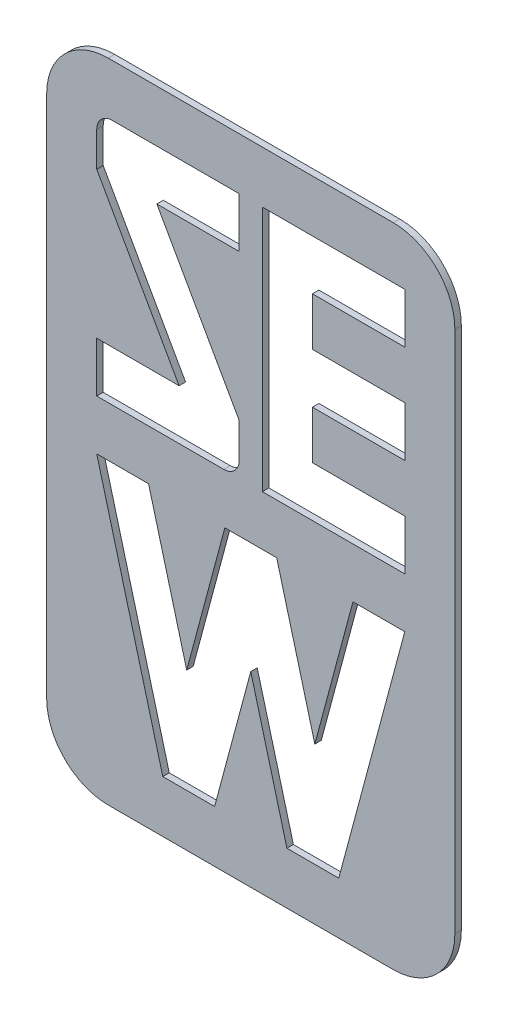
ISO-10303-21;
HEADER;
FILE_DESCRIPTION(('STEP AP214'),'2;1');
FILE_NAME('part.step','',(''),(''),'','','');
FILE_SCHEMA(('AUTOMOTIVE_DESIGN { 1 0 10303 214 1 1 1 1 }'));
ENDSEC;
DATA;
#1=APPLICATION_CONTEXT('core data for automotive mechanical design processes');
#2=APPLICATION_PROTOCOL_DEFINITION('international standard','automotive_design',2000,#1);
#3=PRODUCT_CONTEXT('',#1,'mechanical');
#4=PRODUCT('Part','Part','',(#3));
#5=PRODUCT_RELATED_PRODUCT_CATEGORY('part','',(#4));
#6=PRODUCT_DEFINITION_FORMATION('','',#4);
#7=PRODUCT_DEFINITION_CONTEXT('part definition',#1,'design');
#8=PRODUCT_DEFINITION('design','',#6,#7);
#9=PRODUCT_DEFINITION_SHAPE('','',#8);
#10=(LENGTH_UNIT() NAMED_UNIT(*) SI_UNIT(.MILLI.,.METRE.));
#11=(NAMED_UNIT(*) PLANE_ANGLE_UNIT() SI_UNIT($,.RADIAN.));
#12=(NAMED_UNIT(*) SI_UNIT($,.STERADIAN.) SOLID_ANGLE_UNIT());
#13=UNCERTAINTY_MEASURE_WITH_UNIT(LENGTH_MEASURE(1.E-05),#10,'distance_accuracy_value','');
#14=(GEOMETRIC_REPRESENTATION_CONTEXT(3) GLOBAL_UNCERTAINTY_ASSIGNED_CONTEXT((#13)) GLOBAL_UNIT_ASSIGNED_CONTEXT((#10,
#11,#12)) REPRESENTATION_CONTEXT('',''));
#15=CARTESIAN_POINT('',(0.,0.,0.));
#16=DIRECTION('',(0.,0.,1.));
#17=DIRECTION('',(1.,0.,0.));
#18=AXIS2_PLACEMENT_3D('',#15,#16,#17);
#19=CARTESIAN_POINT('',(413.81,82.63,155.5));
#20=DIRECTION('',(0.965925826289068,-0.258819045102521,0.));
#21=DIRECTION('',(0.258819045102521,0.965925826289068,0.));
#22=AXIS2_PLACEMENT_3D('',#19,#20,#21);
#23=PLANE('',#22);
#24=DIRECTION('',(0.,0.,1.));
#25=VECTOR('',#24,1.);
#26=CARTESIAN_POINT('',(413.81,82.63,155.5));
#27=LINE('',#26,#25);
#28=CARTESIAN_POINT('',(413.81,82.63,156.5));
#29=VERTEX_POINT('',#28);
#30=CARTESIAN_POINT('',(413.81,82.63,155.5));
#31=VERTEX_POINT('',#30);
#32=EDGE_CURVE('E246',#29,#31,#27,.F.);
#33=ORIENTED_EDGE('',*,*,#32,.T.);
#34=DIRECTION('',(-0.258819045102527,-0.965925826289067,0.));
#35=VECTOR('',#34,1.);
#36=CARTESIAN_POINT('',(413.81,82.63,155.5));
#37=LINE('',#36,#35);
#38=CARTESIAN_POINT('',(403.601135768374,44.53,155.5));
#39=VERTEX_POINT('',#38);
#40=EDGE_CURVE('E240',#31,#39,#37,.T.);
#41=ORIENTED_EDGE('',*,*,#40,.T.);
#42=DIRECTION('',(0.,0.,-1.));
#43=VECTOR('',#42,1.);
#44=CARTESIAN_POINT('',(403.601135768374,44.53,155.5));
#45=LINE('',#44,#43);
#46=CARTESIAN_POINT('',(403.601135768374,44.53,156.5));
#47=VERTEX_POINT('',#46);
#48=EDGE_CURVE('E616',#39,#47,#45,.F.);
#49=ORIENTED_EDGE('',*,*,#48,.T.);
#50=DIRECTION('',(-0.258819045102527,-0.965925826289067,0.));
#51=VECTOR('',#50,1.);
#52=CARTESIAN_POINT('',(413.81,82.63,156.5));
#53=LINE('',#52,#51);
#54=EDGE_CURVE('E352',#29,#47,#53,.T.);
#55=ORIENTED_EDGE('',*,*,#54,.F.);
#56=EDGE_LOOP('',(#33,#41,#49,#55));
#57=FACE_BOUND('',#56,.T.);
#58=ADVANCED_FACE('F16',(#57),#23,.F.);
#59=CARTESIAN_POINT('',(403.601135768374,44.53,155.5));
#60=DIRECTION('',(0.,-1.,0.));
#61=DIRECTION('',(0.,0.,-1.));
#62=AXIS2_PLACEMENT_3D('',#59,#60,#61);
#63=PLANE('',#62);
#64=ORIENTED_EDGE('',*,*,#48,.F.);
#65=DIRECTION('',(1.,0.,0.));
#66=VECTOR('',#65,1.);
#67=CARTESIAN_POINT('',(390.,44.53,155.5));
#68=LINE('',#67,#66);
#69=CARTESIAN_POINT('',(395.588098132,44.53,155.5));
#70=VERTEX_POINT('',#69);
#71=EDGE_CURVE('E237',#39,#70,#68,.F.);
#72=ORIENTED_EDGE('',*,*,#71,.T.);
#73=DIRECTION('',(0.,0.,1.));
#74=VECTOR('',#73,1.);
#75=CARTESIAN_POINT('',(395.588098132,44.53,155.5));
#76=LINE('',#75,#74);
#77=CARTESIAN_POINT('',(395.588098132,44.53,156.5));
#78=VERTEX_POINT('',#77);
#79=EDGE_CURVE('E613',#70,#78,#76,.T.);
#80=ORIENTED_EDGE('',*,*,#79,.T.);
#81=DIRECTION('',(1.,0.,0.));
#82=VECTOR('',#81,1.);
#83=CARTESIAN_POINT('',(390.,44.53,156.5));
#84=LINE('',#83,#82);
#85=EDGE_CURVE('E349',#47,#78,#84,.F.);
#86=ORIENTED_EDGE('',*,*,#85,.F.);
#87=EDGE_LOOP('',(#64,#72,#80,#86));
#88=FACE_BOUND('',#87,.T.);
#89=ADVANCED_FACE('F628',(#88),#63,.F.);
#90=CARTESIAN_POINT('',(395.588098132,44.53,155.5));
#91=DIRECTION('',(-0.965925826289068,-0.258819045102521,0.));
#92=DIRECTION('',(0.258819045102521,-0.965925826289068,0.));
#93=AXIS2_PLACEMENT_3D('',#90,#91,#92);
#94=PLANE('',#93);
#95=ORIENTED_EDGE('',*,*,#79,.F.);
#96=DIRECTION('',(-0.258819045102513,0.96592582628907,0.));
#97=VECTOR('',#96,1.);
#98=CARTESIAN_POINT('',(395.588098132,44.53,155.5));
#99=LINE('',#98,#97);
#100=CARTESIAN_POINT('',(390.,65.3850661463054,155.5));
#101=VERTEX_POINT('',#100);
#102=EDGE_CURVE('E234',#70,#101,#99,.T.);
#103=ORIENTED_EDGE('',*,*,#102,.T.);
#104=DIRECTION('',(0.,0.,1.));
#105=VECTOR('',#104,1.);
#106=CARTESIAN_POINT('',(390.,65.3850661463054,155.5));
#107=LINE('',#106,#105);
#108=CARTESIAN_POINT('',(390.,65.3850661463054,156.5));
#109=VERTEX_POINT('',#108);
#110=EDGE_CURVE('E610',#101,#109,#107,.T.);
#111=ORIENTED_EDGE('',*,*,#110,.T.);
#112=DIRECTION('',(-0.258819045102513,0.96592582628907,0.));
#113=VECTOR('',#112,1.);
#114=CARTESIAN_POINT('',(395.588098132,44.53,156.5));
#115=LINE('',#114,#113);
#116=EDGE_CURVE('E346',#78,#109,#115,.T.);
#117=ORIENTED_EDGE('',*,*,#116,.F.);
#118=EDGE_LOOP('',(#95,#103,#111,#117));
#119=FACE_BOUND('',#118,.T.);
#120=ADVANCED_FACE('F883',(#119),#94,.F.);
#121=CARTESIAN_POINT('',(390.,65.3850661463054,155.5));
#122=DIRECTION('',(0.965925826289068,-0.258819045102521,0.));
#123=DIRECTION('',(0.258819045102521,0.965925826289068,0.));
#124=AXIS2_PLACEMENT_3D('',#121,#122,#123);
#125=PLANE('',#124);
#126=ORIENTED_EDGE('',*,*,#110,.F.);
#127=DIRECTION('',(-0.258819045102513,-0.96592582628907,0.));
#128=VECTOR('',#127,1.);
#129=CARTESIAN_POINT('',(390.,65.3850661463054,155.5));
#130=LINE('',#129,#128);
#131=CARTESIAN_POINT('',(384.411901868,44.53,155.5));
#132=VERTEX_POINT('',#131);
#133=EDGE_CURVE('E231',#101,#132,#130,.T.);
#134=ORIENTED_EDGE('',*,*,#133,.T.);
#135=DIRECTION('',(0.,0.,-1.));
#136=VECTOR('',#135,1.);
#137=CARTESIAN_POINT('',(384.411901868,44.53,155.5));
#138=LINE('',#137,#136);
#139=CARTESIAN_POINT('',(384.411901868,44.53,156.5));
#140=VERTEX_POINT('',#139);
#141=EDGE_CURVE('E607',#132,#140,#138,.F.);
#142=ORIENTED_EDGE('',*,*,#141,.T.);
#143=DIRECTION('',(-0.258819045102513,-0.96592582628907,0.));
#144=VECTOR('',#143,1.);
#145=CARTESIAN_POINT('',(390.,65.3850661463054,156.5));
#146=LINE('',#145,#144);
#147=EDGE_CURVE('E343',#109,#140,#146,.T.);
#148=ORIENTED_EDGE('',*,*,#147,.F.);
#149=EDGE_LOOP('',(#126,#134,#142,#148));
#150=FACE_BOUND('',#149,.T.);
#151=ADVANCED_FACE('F880',(#150),#125,.F.);
#152=CARTESIAN_POINT('',(384.411901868,44.53,155.5));
#153=DIRECTION('',(0.,-1.,0.));
#154=DIRECTION('',(0.,0.,-1.));
#155=AXIS2_PLACEMENT_3D('',#152,#153,#154);
#156=PLANE('',#155);
#157=ORIENTED_EDGE('',*,*,#141,.F.);
#158=DIRECTION('',(1.,0.,0.));
#159=VECTOR('',#158,1.);
#160=CARTESIAN_POINT('',(390.,44.53,155.5));
#161=LINE('',#160,#159);
#162=CARTESIAN_POINT('',(376.398864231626,44.53,155.5));
#163=VERTEX_POINT('',#162);
#164=EDGE_CURVE('E228',#132,#163,#161,.F.);
#165=ORIENTED_EDGE('',*,*,#164,.T.);
#166=DIRECTION('',(0.,0.,1.));
#167=VECTOR('',#166,1.);
#168=CARTESIAN_POINT('',(376.398864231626,44.53,155.5));
#169=LINE('',#168,#167);
#170=CARTESIAN_POINT('',(376.398864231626,44.53,156.5));
#171=VERTEX_POINT('',#170);
#172=EDGE_CURVE('E604',#163,#171,#169,.T.);
#173=ORIENTED_EDGE('',*,*,#172,.T.);
#174=DIRECTION('',(1.,0.,0.));
#175=VECTOR('',#174,1.);
#176=CARTESIAN_POINT('',(390.,44.53,156.5));
#177=LINE('',#176,#175);
#178=EDGE_CURVE('E340',#140,#171,#177,.F.);
#179=ORIENTED_EDGE('',*,*,#178,.F.);
#180=EDGE_LOOP('',(#157,#165,#173,#179));
#181=FACE_BOUND('',#180,.T.);
#182=ADVANCED_FACE('F876',(#181),#156,.F.);
#183=CARTESIAN_POINT('',(376.398864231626,44.53,155.5));
#184=DIRECTION('',(-0.965925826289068,-0.258819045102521,0.));
#185=DIRECTION('',(0.258819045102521,-0.965925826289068,0.));
#186=AXIS2_PLACEMENT_3D('',#183,#184,#185);
#187=PLANE('',#186);
#188=ORIENTED_EDGE('',*,*,#172,.F.);
#189=DIRECTION('',(-0.258819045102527,0.965925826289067,0.));
#190=VECTOR('',#189,1.);
#191=CARTESIAN_POINT('',(376.398864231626,44.53,155.5));
#192=LINE('',#191,#190);
#193=CARTESIAN_POINT('',(366.19,82.63,155.5));
#194=VERTEX_POINT('',#193);
#195=EDGE_CURVE('E225',#163,#194,#192,.T.);
#196=ORIENTED_EDGE('',*,*,#195,.T.);
#197=DIRECTION('',(0.,0.,1.));
#198=VECTOR('',#197,1.);
#199=CARTESIAN_POINT('',(366.19,82.63,155.5));
#200=LINE('',#199,#198);
#201=CARTESIAN_POINT('',(366.19,82.63,156.5));
#202=VERTEX_POINT('',#201);
#203=EDGE_CURVE('E601',#194,#202,#200,.T.);
#204=ORIENTED_EDGE('',*,*,#203,.T.);
#205=DIRECTION('',(-0.258819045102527,0.965925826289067,0.));
#206=VECTOR('',#205,1.);
#207=CARTESIAN_POINT('',(376.398864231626,44.53,156.5));
#208=LINE('',#207,#206);
#209=EDGE_CURVE('E337',#171,#202,#208,.T.);
#210=ORIENTED_EDGE('',*,*,#209,.F.);
#211=EDGE_LOOP('',(#188,#196,#204,#210));
#212=FACE_BOUND('',#211,.T.);
#213=ADVANCED_FACE('F872',(#212),#187,.F.);
#214=CARTESIAN_POINT('',(366.19,82.63,155.5));
#215=DIRECTION('',(0.,1.,0.));
#216=DIRECTION('',(0.,0.,1.));
#217=AXIS2_PLACEMENT_3D('',#214,#215,#216);
#218=PLANE('',#217);
#219=ORIENTED_EDGE('',*,*,#203,.F.);
#220=DIRECTION('',(1.,0.,0.));
#221=VECTOR('',#220,1.);
#222=CARTESIAN_POINT('',(390.,82.63,155.5));
#223=LINE('',#222,#221);
#224=CARTESIAN_POINT('',(374.203037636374,82.63,155.5));
#225=VERTEX_POINT('',#224);
#226=EDGE_CURVE('E222',#194,#225,#223,.T.);
#227=ORIENTED_EDGE('',*,*,#226,.T.);
#228=DIRECTION('',(0.,0.,1.));
#229=VECTOR('',#228,1.);
#230=CARTESIAN_POINT('',(374.203037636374,82.63,155.5));
#231=LINE('',#230,#229);
#232=CARTESIAN_POINT('',(374.203037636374,82.63,156.5));
#233=VERTEX_POINT('',#232);
#234=EDGE_CURVE('E598',#225,#233,#231,.T.);
#235=ORIENTED_EDGE('',*,*,#234,.T.);
#236=DIRECTION('',(1.,0.,0.));
#237=VECTOR('',#236,1.);
#238=CARTESIAN_POINT('',(390.,82.63,156.5));
#239=LINE('',#238,#237);
#240=EDGE_CURVE('E334',#202,#233,#239,.T.);
#241=ORIENTED_EDGE('',*,*,#240,.F.);
#242=EDGE_LOOP('',(#219,#227,#235,#241));
#243=FACE_BOUND('',#242,.T.);
#244=ADVANCED_FACE('F868',(#243),#218,.F.);
#245=CARTESIAN_POINT('',(374.203037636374,82.63,155.5));
#246=DIRECTION('',(0.965925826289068,0.258819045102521,0.));
#247=DIRECTION('',(-0.258819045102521,0.965925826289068,0.));
#248=AXIS2_PLACEMENT_3D('',#245,#246,#247);
#249=PLANE('',#248);
#250=ORIENTED_EDGE('',*,*,#234,.F.);
#251=DIRECTION('',(0.2588190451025,-0.965925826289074,0.));
#252=VECTOR('',#251,1.);
#253=CARTESIAN_POINT('',(374.203037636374,82.63,155.5));
#254=LINE('',#253,#252);
#255=CARTESIAN_POINT('',(380.098259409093,60.6287328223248,155.5));
#256=VERTEX_POINT('',#255);
#257=EDGE_CURVE('E219',#225,#256,#254,.T.);
#258=ORIENTED_EDGE('',*,*,#257,.T.);
#259=DIRECTION('',(0.,0.,1.));
#260=VECTOR('',#259,1.);
#261=CARTESIAN_POINT('',(380.098259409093,60.6287328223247,155.5));
#262=LINE('',#261,#260);
#263=CARTESIAN_POINT('',(380.098259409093,60.6287328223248,156.5));
#264=VERTEX_POINT('',#263);
#265=EDGE_CURVE('E595',#256,#264,#262,.T.);
#266=ORIENTED_EDGE('',*,*,#265,.T.);
#267=DIRECTION('',(0.2588190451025,-0.965925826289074,0.));
#268=VECTOR('',#267,1.);
#269=CARTESIAN_POINT('',(374.203037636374,82.63,156.5));
#270=LINE('',#269,#268);
#271=EDGE_CURVE('E331',#233,#264,#270,.T.);
#272=ORIENTED_EDGE('',*,*,#271,.F.);
#273=EDGE_LOOP('',(#250,#258,#266,#272));
#274=FACE_BOUND('',#273,.T.);
#275=ADVANCED_FACE('F864',(#274),#249,.F.);
#276=CARTESIAN_POINT('',(380.098259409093,60.6287328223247,155.5));
#277=DIRECTION('',(-0.965925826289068,0.258819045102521,0.));
#278=DIRECTION('',(-0.258819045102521,-0.965925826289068,0.));
#279=AXIS2_PLACEMENT_3D('',#276,#277,#278);
#280=PLANE('',#279);
#281=ORIENTED_EDGE('',*,*,#265,.F.);
#282=DIRECTION('',(0.258819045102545,0.965925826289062,0.));
#283=VECTOR('',#282,1.);
#284=CARTESIAN_POINT('',(380.098259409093,60.6287328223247,155.5));
#285=LINE('',#284,#283);
#286=CARTESIAN_POINT('',(385.993481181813,82.6300000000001,155.5));
#287=VERTEX_POINT('',#286);
#288=EDGE_CURVE('E216',#256,#287,#285,.T.);
#289=ORIENTED_EDGE('',*,*,#288,.T.);
#290=DIRECTION('',(0.,0.,1.));
#291=VECTOR('',#290,1.);
#292=CARTESIAN_POINT('',(385.993481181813,82.63,155.5));
#293=LINE('',#292,#291);
#294=CARTESIAN_POINT('',(385.993481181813,82.6300000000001,156.5));
#295=VERTEX_POINT('',#294);
#296=EDGE_CURVE('E448',#287,#295,#293,.T.);
#297=ORIENTED_EDGE('',*,*,#296,.T.);
#298=DIRECTION('',(0.258819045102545,0.965925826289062,0.));
#299=VECTOR('',#298,1.);
#300=CARTESIAN_POINT('',(380.098259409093,60.6287328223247,156.5));
#301=LINE('',#300,#299);
#302=EDGE_CURVE('E328',#264,#295,#301,.T.);
#303=ORIENTED_EDGE('',*,*,#302,.F.);
#304=EDGE_LOOP('',(#281,#289,#297,#303));
#305=FACE_BOUND('',#304,.T.);
#306=ADVANCED_FACE('F860',(#305),#280,.F.);
#307=CARTESIAN_POINT('',(385.993481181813,82.63,155.5));
#308=DIRECTION('',(0.,1.,0.));
#309=DIRECTION('',(0.,0.,1.));
#310=AXIS2_PLACEMENT_3D('',#307,#308,#309);
#311=PLANE('',#310);
#312=ORIENTED_EDGE('',*,*,#296,.F.);
#313=DIRECTION('',(1.,0.,0.));
#314=VECTOR('',#313,1.);
#315=CARTESIAN_POINT('',(390.,82.63,155.5));
#316=LINE('',#315,#314);
#317=CARTESIAN_POINT('',(394.006518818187,82.63,155.5));
#318=VERTEX_POINT('',#317);
#319=EDGE_CURVE('E213',#287,#318,#316,.T.);
#320=ORIENTED_EDGE('',*,*,#319,.T.);
#321=DIRECTION('',(0.,0.,1.));
#322=VECTOR('',#321,1.);
#323=CARTESIAN_POINT('',(394.006518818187,82.63,155.5));
#324=LINE('',#323,#322);
#325=CARTESIAN_POINT('',(394.006518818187,82.63,156.5));
#326=VERTEX_POINT('',#325);
#327=EDGE_CURVE('E247',#318,#326,#324,.T.);
#328=ORIENTED_EDGE('',*,*,#327,.T.);
#329=DIRECTION('',(1.,0.,0.));
#330=VECTOR('',#329,1.);
#331=CARTESIAN_POINT('',(390.,82.63,156.5));
#332=LINE('',#331,#330);
#333=EDGE_CURVE('E326',#295,#326,#332,.T.);
#334=ORIENTED_EDGE('',*,*,#333,.F.);
#335=EDGE_LOOP('',(#312,#320,#328,#334));
#336=FACE_BOUND('',#335,.T.);
#337=ADVANCED_FACE('F856',(#336),#311,.F.);
#338=CARTESIAN_POINT('',(366.19,90.37,155.5));
#339=DIRECTION('',(-1.,0.,0.));
#340=DIRECTION('',(0.,0.,1.));
#341=AXIS2_PLACEMENT_3D('',#338,#339,#340);
#342=PLANE('',#341);
#343=DIRECTION('',(0.,0.,-1.));
#344=VECTOR('',#343,1.);
#345=CARTESIAN_POINT('',(366.19,90.37,155.5));
#346=LINE('',#345,#344);
#347=CARTESIAN_POINT('',(366.19,90.37,156.5));
#348=VERTEX_POINT('',#347);
#349=CARTESIAN_POINT('',(366.19,90.37,155.5));
#350=VERTEX_POINT('',#349);
#351=EDGE_CURVE('E389',#348,#350,#346,.T.);
#352=ORIENTED_EDGE('',*,*,#351,.T.);
#353=DIRECTION('',(0.,1.,0.));
#354=VECTOR('',#353,1.);
#355=CARTESIAN_POINT('',(366.19,86.5,155.5));
#356=LINE('',#355,#354);
#357=CARTESIAN_POINT('',(366.19,98.11,155.5));
#358=VERTEX_POINT('',#357);
#359=EDGE_CURVE('E451',#350,#358,#356,.T.);
#360=ORIENTED_EDGE('',*,*,#359,.T.);
#361=DIRECTION('',(0.,0.,1.));
#362=VECTOR('',#361,1.);
#363=CARTESIAN_POINT('',(366.19,98.11,155.5));
#364=LINE('',#363,#362);
#365=CARTESIAN_POINT('',(366.19,98.11,156.5));
#366=VERTEX_POINT('',#365);
#367=EDGE_CURVE('E440',#358,#366,#364,.T.);
#368=ORIENTED_EDGE('',*,*,#367,.T.);
#369=DIRECTION('',(0.,1.,0.));
#370=VECTOR('',#369,1.);
#371=CARTESIAN_POINT('',(366.19,86.5,156.5));
#372=LINE('',#371,#370);
#373=EDGE_CURVE('E325',#348,#366,#372,.T.);
#374=ORIENTED_EDGE('',*,*,#373,.F.);
#375=EDGE_LOOP('',(#352,#360,#368,#374));
#376=FACE_BOUND('',#375,.T.);
#377=ADVANCED_FACE('F793',(#376),#342,.F.);
#378=CARTESIAN_POINT('',(366.19,98.11,155.5));
#379=DIRECTION('',(0.,1.,0.));
#380=DIRECTION('',(0.,0.,1.));
#381=AXIS2_PLACEMENT_3D('',#378,#379,#380);
#382=PLANE('',#381);
#383=ORIENTED_EDGE('',*,*,#367,.F.);
#384=DIRECTION('',(1.,0.,0.));
#385=VECTOR('',#384,1.);
#386=CARTESIAN_POINT('',(390.,98.11,155.5));
#387=LINE('',#386,#385);
#388=CARTESIAN_POINT('',(378.922,98.11,155.5));
#389=VERTEX_POINT('',#388);
#390=EDGE_CURVE('E206',#358,#389,#387,.T.);
#391=ORIENTED_EDGE('',*,*,#390,.T.);
#392=DIRECTION('',(0.,0.,1.));
#393=VECTOR('',#392,1.);
#394=CARTESIAN_POINT('',(378.922,98.11,155.5));
#395=LINE('',#394,#393);
#396=CARTESIAN_POINT('',(378.922,98.11,156.5));
#397=VERTEX_POINT('',#396);
#398=EDGE_CURVE('E432',#389,#397,#395,.T.);
#399=ORIENTED_EDGE('',*,*,#398,.T.);
#400=DIRECTION('',(1.,0.,0.));
#401=VECTOR('',#400,1.);
#402=CARTESIAN_POINT('',(390.,98.11,156.5));
#403=LINE('',#402,#401);
#404=EDGE_CURVE('E395',#366,#397,#403,.T.);
#405=ORIENTED_EDGE('',*,*,#404,.F.);
#406=EDGE_LOOP('',(#383,#391,#399,#405));
#407=FACE_BOUND('',#406,.T.);
#408=ADVANCED_FACE('F797',(#407),#382,.F.);
#409=CARTESIAN_POINT('',(378.922,98.11,155.5));
#410=DIRECTION('',(-0.871439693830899,-0.490502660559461,0.));
#411=DIRECTION('',(0.490502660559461,-0.871439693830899,0.));
#412=AXIS2_PLACEMENT_3D('',#409,#410,#411);
#413=PLANE('',#412);
#414=ORIENTED_EDGE('',*,*,#398,.F.);
#415=DIRECTION('',(-0.490502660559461,0.871439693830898,0.));
#416=VECTOR('',#415,1.);
#417=CARTESIAN_POINT('',(378.922,98.11,155.5));
#418=LINE('',#417,#416);
#419=CARTESIAN_POINT('',(366.19,120.73,155.5));
#420=VERTEX_POINT('',#419);
#421=EDGE_CURVE('E202',#389,#420,#418,.T.);
#422=ORIENTED_EDGE('',*,*,#421,.T.);
#423=DIRECTION('',(0.,0.,1.));
#424=VECTOR('',#423,1.);
#425=CARTESIAN_POINT('',(366.19,120.73,155.5));
#426=LINE('',#425,#424);
#427=CARTESIAN_POINT('',(366.19,120.73,156.5));
#428=VERTEX_POINT('',#427);
#429=EDGE_CURVE('E429',#420,#428,#426,.T.);
#430=ORIENTED_EDGE('',*,*,#429,.T.);
#431=DIRECTION('',(-0.490502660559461,0.871439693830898,0.));
#432=VECTOR('',#431,1.);
#433=CARTESIAN_POINT('',(378.922,98.11,156.5));
#434=LINE('',#433,#432);
#435=EDGE_CURVE('E321',#397,#428,#434,.T.);
#436=ORIENTED_EDGE('',*,*,#435,.F.);
#437=EDGE_LOOP('',(#414,#422,#430,#436));
#438=FACE_BOUND('',#437,.T.);
#439=ADVANCED_FACE('F802',(#438),#413,.F.);
#440=CARTESIAN_POINT('',(366.19,120.73,155.5));
#441=DIRECTION('',(-1.,0.,0.));
#442=DIRECTION('',(0.,0.,1.));
#443=AXIS2_PLACEMENT_3D('',#440,#441,#442);
#444=PLANE('',#443);
#445=ORIENTED_EDGE('',*,*,#429,.F.);
#446=DIRECTION('',(0.,1.,0.));
#447=VECTOR('',#446,1.);
#448=CARTESIAN_POINT('',(366.19,86.5,155.5));
#449=LINE('',#448,#447);
#450=CARTESIAN_POINT('',(366.19,126.09,155.5));
#451=VERTEX_POINT('',#450);
#452=EDGE_CURVE('E201',#420,#451,#449,.T.);
#453=ORIENTED_EDGE('',*,*,#452,.T.);
#454=DIRECTION('',(0.,0.,1.));
#455=VECTOR('',#454,1.);
#456=CARTESIAN_POINT('',(366.19,126.09,155.5));
#457=LINE('',#456,#455);
#458=CARTESIAN_POINT('',(366.19,126.09,156.5));
#459=VERTEX_POINT('',#458);
#460=EDGE_CURVE('E174',#451,#459,#457,.T.);
#461=ORIENTED_EDGE('',*,*,#460,.T.);
#462=DIRECTION('',(0.,1.,0.));
#463=VECTOR('',#462,1.);
#464=CARTESIAN_POINT('',(366.19,86.5,156.5));
#465=LINE('',#464,#463);
#466=EDGE_CURVE('E319',#428,#459,#465,.T.);
#467=ORIENTED_EDGE('',*,*,#466,.F.);
#468=EDGE_LOOP('',(#445,#453,#461,#467));
#469=FACE_BOUND('',#468,.T.);
#470=ADVANCED_FACE('F803',(#469),#444,.F.);
#471=CARTESIAN_POINT('',(368.57,126.09,155.5));
#472=DIRECTION('',(0.,0.,1.));
#473=DIRECTION('',(1.,0.,0.));
#474=AXIS2_PLACEMENT_3D('',#471,#472,#473);
#475=CYLINDRICAL_SURFACE('',#474,2.38000000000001);
#476=ORIENTED_EDGE('',*,*,#460,.F.);
#477=CARTESIAN_POINT('',(368.57,126.09,155.5));
#478=DIRECTION('',(0.,0.,1.));
#479=DIRECTION('',(1.,0.,0.));
#480=AXIS2_PLACEMENT_3D('',#477,#478,#479);
#481=CIRCLE('',#480,2.38000000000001);
#482=CARTESIAN_POINT('',(368.57,128.47,155.5));
#483=VERTEX_POINT('',#482);
#484=EDGE_CURVE('E20',#451,#483,#481,.F.);
#485=ORIENTED_EDGE('',*,*,#484,.T.);
#486=DIRECTION('',(0.,0.,1.));
#487=VECTOR('',#486,1.);
#488=CARTESIAN_POINT('',(368.57,128.47,155.5));
#489=LINE('',#488,#487);
#490=CARTESIAN_POINT('',(368.57,128.47,156.5));
#491=VERTEX_POINT('',#490);
#492=EDGE_CURVE('E181',#483,#491,#489,.T.);
#493=ORIENTED_EDGE('',*,*,#492,.T.);
#494=CARTESIAN_POINT('',(368.57,126.09,156.5));
#495=DIRECTION('',(0.,0.,1.));
#496=DIRECTION('',(1.,0.,0.));
#497=AXIS2_PLACEMENT_3D('',#494,#495,#496);
#498=CIRCLE('',#497,2.38000000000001);
#499=EDGE_CURVE('E316',#459,#491,#498,.F.);
#500=ORIENTED_EDGE('',*,*,#499,.F.);
#501=EDGE_LOOP('',(#476,#485,#493,#500));
#502=FACE_BOUND('',#501,.T.);
#503=ADVANCED_FACE('F200',(#502),#475,.F.);
#504=CARTESIAN_POINT('',(368.57,128.47,155.5));
#505=DIRECTION('',(0.,1.,0.));
#506=DIRECTION('',(0.,0.,1.));
#507=AXIS2_PLACEMENT_3D('',#504,#505,#506);
#508=PLANE('',#507);
#509=ORIENTED_EDGE('',*,*,#492,.F.);
#510=DIRECTION('',(1.,0.,0.));
#511=VECTOR('',#510,1.);
#512=CARTESIAN_POINT('',(390.,128.47,155.5));
#513=LINE('',#512,#511);
#514=CARTESIAN_POINT('',(388.21,128.47,155.5));
#515=VERTEX_POINT('',#514);
#516=EDGE_CURVE('E185',#483,#515,#513,.T.);
#517=ORIENTED_EDGE('',*,*,#516,.T.);
#518=DIRECTION('',(0.,0.,-1.));
#519=VECTOR('',#518,1.);
#520=CARTESIAN_POINT('',(388.21,128.47,155.5));
#521=LINE('',#520,#519);
#522=CARTESIAN_POINT('',(388.21,128.47,156.5));
#523=VERTEX_POINT('',#522);
#524=EDGE_CURVE('E187',#515,#523,#521,.F.);
#525=ORIENTED_EDGE('',*,*,#524,.T.);
#526=DIRECTION('',(1.,0.,0.));
#527=VECTOR('',#526,1.);
#528=CARTESIAN_POINT('',(390.,128.47,156.5));
#529=LINE('',#528,#527);
#530=EDGE_CURVE('E186',#491,#523,#529,.T.);
#531=ORIENTED_EDGE('',*,*,#530,.F.);
#532=EDGE_LOOP('',(#509,#517,#525,#531));
#533=FACE_BOUND('',#532,.T.);
#534=ADVANCED_FACE('F183',(#533),#508,.F.);
#535=CARTESIAN_POINT('',(388.21,128.47,155.5));
#536=DIRECTION('',(1.,0.,0.));
#537=DIRECTION('',(0.,0.,-1.));
#538=AXIS2_PLACEMENT_3D('',#535,#536,#537);
#539=PLANE('',#538);
#540=ORIENTED_EDGE('',*,*,#524,.F.);
#541=DIRECTION('',(0.,1.,0.));
#542=VECTOR('',#541,1.);
#543=CARTESIAN_POINT('',(388.21,86.5,155.5));
#544=LINE('',#543,#542);
#545=CARTESIAN_POINT('',(388.21,120.73,155.5));
#546=VERTEX_POINT('',#545);
#547=EDGE_CURVE('E198',#515,#546,#544,.F.);
#548=ORIENTED_EDGE('',*,*,#547,.T.);
#549=DIRECTION('',(0.,0.,-1.));
#550=VECTOR('',#549,1.);
#551=CARTESIAN_POINT('',(388.21,120.73,155.5));
#552=LINE('',#551,#550);
#553=CARTESIAN_POINT('',(388.21,120.73,156.5));
#554=VERTEX_POINT('',#553);
#555=EDGE_CURVE('E412',#546,#554,#552,.F.);
#556=ORIENTED_EDGE('',*,*,#555,.T.);
#557=DIRECTION('',(0.,1.,0.));
#558=VECTOR('',#557,1.);
#559=CARTESIAN_POINT('',(388.21,86.5,156.5));
#560=LINE('',#559,#558);
#561=EDGE_CURVE('E315',#523,#554,#560,.F.);
#562=ORIENTED_EDGE('',*,*,#561,.F.);
#563=EDGE_LOOP('',(#540,#548,#556,#562));
#564=FACE_BOUND('',#563,.T.);
#565=ADVANCED_FACE('F806',(#564),#539,.F.);
#566=CARTESIAN_POINT('',(388.21,120.73,155.5));
#567=DIRECTION('',(0.,-1.,0.));
#568=DIRECTION('',(0.,0.,-1.));
#569=AXIS2_PLACEMENT_3D('',#566,#567,#568);
#570=PLANE('',#569);
#571=ORIENTED_EDGE('',*,*,#555,.F.);
#572=DIRECTION('',(1.,0.,0.));
#573=VECTOR('',#572,1.);
#574=CARTESIAN_POINT('',(390.,120.73,155.5));
#575=LINE('',#574,#573);
#576=CARTESIAN_POINT('',(375.478,120.73,155.5));
#577=VERTEX_POINT('',#576);
#578=EDGE_CURVE('E462',#546,#577,#575,.F.);
#579=ORIENTED_EDGE('',*,*,#578,.T.);
#580=DIRECTION('',(0.,0.,1.));
#581=VECTOR('',#580,1.);
#582=CARTESIAN_POINT('',(375.478,120.73,155.5));
#583=LINE('',#582,#581);
#584=CARTESIAN_POINT('',(375.478,120.73,156.5));
#585=VERTEX_POINT('',#584);
#586=EDGE_CURVE('E403',#577,#585,#583,.T.);
#587=ORIENTED_EDGE('',*,*,#586,.T.);
#588=DIRECTION('',(1.,0.,0.));
#589=VECTOR('',#588,1.);
#590=CARTESIAN_POINT('',(390.,120.73,156.5));
#591=LINE('',#590,#589);
#592=EDGE_CURVE('E407',#554,#585,#591,.F.);
#593=ORIENTED_EDGE('',*,*,#592,.F.);
#594=EDGE_LOOP('',(#571,#579,#587,#593));
#595=FACE_BOUND('',#594,.T.);
#596=ADVANCED_FACE('F809',(#595),#570,.F.);
#597=CARTESIAN_POINT('',(375.478,120.73,155.5));
#598=DIRECTION('',(0.871439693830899,0.490502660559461,0.));
#599=DIRECTION('',(-0.490502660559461,0.871439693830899,0.));
#600=AXIS2_PLACEMENT_3D('',#597,#598,#599);
#601=PLANE('',#600);
#602=ORIENTED_EDGE('',*,*,#586,.F.);
#603=DIRECTION('',(0.49050266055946,-0.871439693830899,0.));
#604=VECTOR('',#603,1.);
#605=CARTESIAN_POINT('',(375.478,120.73,155.5));
#606=LINE('',#605,#604);
#607=CARTESIAN_POINT('',(388.21,98.11,155.5));
#608=VERTEX_POINT('',#607);
#609=EDGE_CURVE('E458',#577,#608,#606,.T.);
#610=ORIENTED_EDGE('',*,*,#609,.T.);
#611=DIRECTION('',(0.,0.,-1.));
#612=VECTOR('',#611,1.);
#613=CARTESIAN_POINT('',(388.21,98.11,155.5));
#614=LINE('',#613,#612);
#615=CARTESIAN_POINT('',(388.21,98.11,156.5));
#616=VERTEX_POINT('',#615);
#617=EDGE_CURVE('E400',#608,#616,#614,.F.);
#618=ORIENTED_EDGE('',*,*,#617,.T.);
#619=DIRECTION('',(0.49050266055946,-0.871439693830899,0.));
#620=VECTOR('',#619,1.);
#621=CARTESIAN_POINT('',(375.478,120.73,156.5));
#622=LINE('',#621,#620);
#623=EDGE_CURVE('E311',#585,#616,#622,.T.);
#624=ORIENTED_EDGE('',*,*,#623,.F.);
#625=EDGE_LOOP('',(#602,#610,#618,#624));
#626=FACE_BOUND('',#625,.T.);
#627=ADVANCED_FACE('F812',(#626),#601,.F.);
#628=CARTESIAN_POINT('',(388.21,98.11,155.5));
#629=DIRECTION('',(1.,0.,0.));
#630=DIRECTION('',(0.,0.,-1.));
#631=AXIS2_PLACEMENT_3D('',#628,#629,#630);
#632=PLANE('',#631);
#633=ORIENTED_EDGE('',*,*,#617,.F.);
#634=DIRECTION('',(0.,1.,0.));
#635=VECTOR('',#634,1.);
#636=CARTESIAN_POINT('',(388.21,86.5,155.5));
#637=LINE('',#636,#635);
#638=CARTESIAN_POINT('',(388.21,92.75,155.5));
#639=VERTEX_POINT('',#638);
#640=EDGE_CURVE('E461',#608,#639,#637,.F.);
#641=ORIENTED_EDGE('',*,*,#640,.T.);
#642=DIRECTION('',(0.,0.,1.));
#643=VECTOR('',#642,1.);
#644=CARTESIAN_POINT('',(388.21,92.75,155.5));
#645=LINE('',#644,#643);
#646=CARTESIAN_POINT('',(388.21,92.75,156.5));
#647=VERTEX_POINT('',#646);
#648=EDGE_CURVE('E391',#639,#647,#645,.T.);
#649=ORIENTED_EDGE('',*,*,#648,.T.);
#650=DIRECTION('',(0.,1.,0.));
#651=VECTOR('',#650,1.);
#652=CARTESIAN_POINT('',(388.21,86.5,156.5));
#653=LINE('',#652,#651);
#654=EDGE_CURVE('E309',#616,#647,#653,.F.);
#655=ORIENTED_EDGE('',*,*,#654,.F.);
#656=EDGE_LOOP('',(#633,#641,#649,#655));
#657=FACE_BOUND('',#656,.T.);
#658=ADVANCED_FACE('F814',(#657),#632,.F.);
#659=CARTESIAN_POINT('',(385.83,92.75,155.5));
#660=DIRECTION('',(0.,0.,1.));
#661=DIRECTION('',(1.,0.,0.));
#662=AXIS2_PLACEMENT_3D('',#659,#660,#661);
#663=CYLINDRICAL_SURFACE('',#662,2.37999999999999);
#664=ORIENTED_EDGE('',*,*,#648,.F.);
#665=CARTESIAN_POINT('',(385.83,92.75,155.5));
#666=DIRECTION('',(0.,0.,1.));
#667=DIRECTION('',(1.,0.,0.));
#668=AXIS2_PLACEMENT_3D('',#665,#666,#667);
#669=CIRCLE('',#668,2.37999999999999);
#670=CARTESIAN_POINT('',(385.83,90.37,155.5));
#671=VERTEX_POINT('',#670);
#672=EDGE_CURVE('E500',#639,#671,#669,.F.);
#673=ORIENTED_EDGE('',*,*,#672,.T.);
#674=DIRECTION('',(0.,0.,-1.));
#675=VECTOR('',#674,1.);
#676=CARTESIAN_POINT('',(385.83,90.37,155.5));
#677=LINE('',#676,#675);
#678=CARTESIAN_POINT('',(385.83,90.37,156.5));
#679=VERTEX_POINT('',#678);
#680=EDGE_CURVE('E385',#671,#679,#677,.F.);
#681=ORIENTED_EDGE('',*,*,#680,.T.);
#682=CARTESIAN_POINT('',(385.83,92.75,156.5));
#683=DIRECTION('',(0.,0.,1.));
#684=DIRECTION('',(1.,0.,0.));
#685=AXIS2_PLACEMENT_3D('',#682,#683,#684);
#686=CIRCLE('',#685,2.37999999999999);
#687=EDGE_CURVE('E306',#647,#679,#686,.F.);
#688=ORIENTED_EDGE('',*,*,#687,.F.);
#689=EDGE_LOOP('',(#664,#673,#681,#688));
#690=FACE_BOUND('',#689,.T.);
#691=ADVANCED_FACE('F788',(#690),#663,.F.);
#692=CARTESIAN_POINT('',(385.83,90.37,155.5));
#693=DIRECTION('',(0.,-1.,0.));
#694=DIRECTION('',(0.,0.,-1.));
#695=AXIS2_PLACEMENT_3D('',#692,#693,#694);
#696=PLANE('',#695);
#697=ORIENTED_EDGE('',*,*,#680,.F.);
#698=DIRECTION('',(1.,0.,0.));
#699=VECTOR('',#698,1.);
#700=CARTESIAN_POINT('',(390.,90.37,155.5));
#701=LINE('',#700,#699);
#702=EDGE_CURVE('E455',#671,#350,#701,.F.);
#703=ORIENTED_EDGE('',*,*,#702,.T.);
#704=ORIENTED_EDGE('',*,*,#351,.F.);
#705=DIRECTION('',(1.,0.,0.));
#706=VECTOR('',#705,1.);
#707=CARTESIAN_POINT('',(390.,90.37,156.5));
#708=LINE('',#707,#706);
#709=EDGE_CURVE('E303',#679,#348,#708,.F.);
#710=ORIENTED_EDGE('',*,*,#709,.F.);
#711=EDGE_LOOP('',(#697,#703,#704,#710));
#712=FACE_BOUND('',#711,.T.);
#713=ADVANCED_FACE('F790',(#712),#696,.F.);
#714=CARTESIAN_POINT('',(391.79,90.37,155.5));
#715=DIRECTION('',(-1.,0.,0.));
#716=DIRECTION('',(0.,0.,1.));
#717=AXIS2_PLACEMENT_3D('',#714,#715,#716);
#718=PLANE('',#717);
#719=DIRECTION('',(0.,0.,-1.));
#720=VECTOR('',#719,1.);
#721=CARTESIAN_POINT('',(391.79,90.37,155.5));
#722=LINE('',#721,#720);
#723=CARTESIAN_POINT('',(391.79,90.37,156.5));
#724=VERTEX_POINT('',#723);
#725=CARTESIAN_POINT('',(391.79,90.37,155.5));
#726=VERTEX_POINT('',#725);
#727=EDGE_CURVE('E559',#724,#726,#722,.T.);
#728=ORIENTED_EDGE('',*,*,#727,.T.);
#729=DIRECTION('',(0.,1.,0.));
#730=VECTOR('',#729,1.);
#731=CARTESIAN_POINT('',(391.79,86.5,155.5));
#732=LINE('',#731,#730);
#733=CARTESIAN_POINT('',(391.79,128.47,155.5));
#734=VERTEX_POINT('',#733);
#735=EDGE_CURVE('E499',#726,#734,#732,.T.);
#736=ORIENTED_EDGE('',*,*,#735,.T.);
#737=DIRECTION('',(0.,0.,1.));
#738=VECTOR('',#737,1.);
#739=CARTESIAN_POINT('',(391.79,128.47,155.5));
#740=LINE('',#739,#738);
#741=CARTESIAN_POINT('',(391.79,128.47,156.5));
#742=VERTEX_POINT('',#741);
#743=EDGE_CURVE('E388',#734,#742,#740,.T.);
#744=ORIENTED_EDGE('',*,*,#743,.T.);
#745=DIRECTION('',(0.,1.,0.));
#746=VECTOR('',#745,1.);
#747=CARTESIAN_POINT('',(391.79,86.5,156.5));
#748=LINE('',#747,#746);
#749=EDGE_CURVE('E300',#724,#742,#748,.T.);
#750=ORIENTED_EDGE('',*,*,#749,.F.);
#751=EDGE_LOOP('',(#728,#736,#744,#750));
#752=FACE_BOUND('',#751,.T.);
#753=ADVANCED_FACE('F733',(#752),#718,.F.);
#754=CARTESIAN_POINT('',(391.79,128.47,155.5));
#755=DIRECTION('',(0.,1.,0.));
#756=DIRECTION('',(0.,0.,1.));
#757=AXIS2_PLACEMENT_3D('',#754,#755,#756);
#758=PLANE('',#757);
#759=ORIENTED_EDGE('',*,*,#743,.F.);
#760=DIRECTION('',(1.,0.,0.));
#761=VECTOR('',#760,1.);
#762=CARTESIAN_POINT('',(390.,128.47,155.5));
#763=LINE('',#762,#761);
#764=CARTESIAN_POINT('',(413.81,128.47,155.5));
#765=VERTEX_POINT('',#764);
#766=EDGE_CURVE('E454',#734,#765,#763,.T.);
#767=ORIENTED_EDGE('',*,*,#766,.T.);
#768=DIRECTION('',(0.,0.,-1.));
#769=VECTOR('',#768,1.);
#770=CARTESIAN_POINT('',(413.81,128.47,155.5));
#771=LINE('',#770,#769);
#772=CARTESIAN_POINT('',(413.81,128.47,156.5));
#773=VERTEX_POINT('',#772);
#774=EDGE_CURVE('E588',#765,#773,#771,.F.);
#775=ORIENTED_EDGE('',*,*,#774,.T.);
#776=DIRECTION('',(1.,0.,0.));
#777=VECTOR('',#776,1.);
#778=CARTESIAN_POINT('',(390.,128.47,156.5));
#779=LINE('',#778,#777);
#780=EDGE_CURVE('E297',#742,#773,#779,.T.);
#781=ORIENTED_EDGE('',*,*,#780,.F.);
#782=EDGE_LOOP('',(#759,#767,#775,#781));
#783=FACE_BOUND('',#782,.T.);
#784=ADVANCED_FACE('F777',(#783),#758,.F.);
#785=CARTESIAN_POINT('',(413.81,128.47,155.5));
#786=DIRECTION('',(1.,0.,0.));
#787=DIRECTION('',(0.,0.,-1.));
#788=AXIS2_PLACEMENT_3D('',#785,#786,#787);
#789=PLANE('',#788);
#790=ORIENTED_EDGE('',*,*,#774,.F.);
#791=DIRECTION('',(0.,1.,0.));
#792=VECTOR('',#791,1.);
#793=CARTESIAN_POINT('',(413.81,86.5,155.5));
#794=LINE('',#793,#792);
#795=CARTESIAN_POINT('',(413.81,120.73,155.5));
#796=VERTEX_POINT('',#795);
#797=EDGE_CURVE('E517',#765,#796,#794,.F.);
#798=ORIENTED_EDGE('',*,*,#797,.T.);
#799=DIRECTION('',(0.,0.,-1.));
#800=VECTOR('',#799,1.);
#801=CARTESIAN_POINT('',(413.81,120.73,155.5));
#802=LINE('',#801,#800);
#803=CARTESIAN_POINT('',(413.81,120.73,156.5));
#804=VERTEX_POINT('',#803);
#805=EDGE_CURVE('E585',#796,#804,#802,.F.);
#806=ORIENTED_EDGE('',*,*,#805,.T.);
#807=DIRECTION('',(0.,1.,0.));
#808=VECTOR('',#807,1.);
#809=CARTESIAN_POINT('',(413.81,86.5,156.5));
#810=LINE('',#809,#808);
#811=EDGE_CURVE('E294',#773,#804,#810,.F.);
#812=ORIENTED_EDGE('',*,*,#811,.F.);
#813=EDGE_LOOP('',(#790,#798,#806,#812));
#814=FACE_BOUND('',#813,.T.);
#815=ADVANCED_FACE('F775',(#814),#789,.F.);
#816=CARTESIAN_POINT('',(413.81,120.73,155.5));
#817=DIRECTION('',(0.,-1.,0.));
#818=DIRECTION('',(0.,0.,-1.));
#819=AXIS2_PLACEMENT_3D('',#816,#817,#818);
#820=PLANE('',#819);
#821=ORIENTED_EDGE('',*,*,#805,.F.);
#822=DIRECTION('',(1.,0.,0.));
#823=VECTOR('',#822,1.);
#824=CARTESIAN_POINT('',(390.,120.73,155.5));
#825=LINE('',#824,#823);
#826=CARTESIAN_POINT('',(399.53,120.73,155.5));
#827=VERTEX_POINT('',#826);
#828=EDGE_CURVE('E520',#796,#827,#825,.F.);
#829=ORIENTED_EDGE('',*,*,#828,.T.);
#830=DIRECTION('',(0.,0.,-1.));
#831=VECTOR('',#830,1.);
#832=CARTESIAN_POINT('',(399.53,120.73,155.5));
#833=LINE('',#832,#831);
#834=CARTESIAN_POINT('',(399.53,120.73,156.5));
#835=VERTEX_POINT('',#834);
#836=EDGE_CURVE('E582',#827,#835,#833,.F.);
#837=ORIENTED_EDGE('',*,*,#836,.T.);
#838=DIRECTION('',(1.,0.,0.));
#839=VECTOR('',#838,1.);
#840=CARTESIAN_POINT('',(390.,120.73,156.5));
#841=LINE('',#840,#839);
#842=EDGE_CURVE('E291',#804,#835,#841,.F.);
#843=ORIENTED_EDGE('',*,*,#842,.F.);
#844=EDGE_LOOP('',(#821,#829,#837,#843));
#845=FACE_BOUND('',#844,.T.);
#846=ADVANCED_FACE('F771',(#845),#820,.F.);
#847=CARTESIAN_POINT('',(399.53,120.73,155.5));
#848=DIRECTION('',(1.,0.,0.));
#849=DIRECTION('',(0.,0.,-1.));
#850=AXIS2_PLACEMENT_3D('',#847,#848,#849);
#851=PLANE('',#850);
#852=ORIENTED_EDGE('',*,*,#836,.F.);
#853=DIRECTION('',(0.,1.,0.));
#854=VECTOR('',#853,1.);
#855=CARTESIAN_POINT('',(399.53,86.5,155.5));
#856=LINE('',#855,#854);
#857=CARTESIAN_POINT('',(399.53,113.29,155.5));
#858=VERTEX_POINT('',#857);
#859=EDGE_CURVE('E523',#827,#858,#856,.F.);
#860=ORIENTED_EDGE('',*,*,#859,.T.);
#861=DIRECTION('',(0.,0.,1.));
#862=VECTOR('',#861,1.);
#863=CARTESIAN_POINT('',(399.53,113.29,155.5));
#864=LINE('',#863,#862);
#865=CARTESIAN_POINT('',(399.53,113.29,156.5));
#866=VERTEX_POINT('',#865);
#867=EDGE_CURVE('E579',#858,#866,#864,.T.);
#868=ORIENTED_EDGE('',*,*,#867,.T.);
#869=DIRECTION('',(0.,1.,0.));
#870=VECTOR('',#869,1.);
#871=CARTESIAN_POINT('',(399.53,86.5,156.5));
#872=LINE('',#871,#870);
#873=EDGE_CURVE('E288',#835,#866,#872,.F.);
#874=ORIENTED_EDGE('',*,*,#873,.F.);
#875=EDGE_LOOP('',(#852,#860,#868,#874));
#876=FACE_BOUND('',#875,.T.);
#877=ADVANCED_FACE('F768',(#876),#851,.F.);
#878=CARTESIAN_POINT('',(399.53,113.29,155.5));
#879=DIRECTION('',(0.,1.,0.));
#880=DIRECTION('',(0.,0.,1.));
#881=AXIS2_PLACEMENT_3D('',#878,#879,#880);
#882=PLANE('',#881);
#883=ORIENTED_EDGE('',*,*,#867,.F.);
#884=DIRECTION('',(1.,0.,0.));
#885=VECTOR('',#884,1.);
#886=CARTESIAN_POINT('',(390.,113.29,155.5));
#887=LINE('',#886,#885);
#888=CARTESIAN_POINT('',(413.81,113.29,155.5));
#889=VERTEX_POINT('',#888);
#890=EDGE_CURVE('E526',#858,#889,#887,.T.);
#891=ORIENTED_EDGE('',*,*,#890,.T.);
#892=DIRECTION('',(0.,0.,-1.));
#893=VECTOR('',#892,1.);
#894=CARTESIAN_POINT('',(413.81,113.29,155.5));
#895=LINE('',#894,#893);
#896=CARTESIAN_POINT('',(413.81,113.29,156.5));
#897=VERTEX_POINT('',#896);
#898=EDGE_CURVE('E576',#889,#897,#895,.F.);
#899=ORIENTED_EDGE('',*,*,#898,.T.);
#900=DIRECTION('',(1.,0.,0.));
#901=VECTOR('',#900,1.);
#902=CARTESIAN_POINT('',(390.,113.29,156.5));
#903=LINE('',#902,#901);
#904=EDGE_CURVE('E285',#866,#897,#903,.T.);
#905=ORIENTED_EDGE('',*,*,#904,.F.);
#906=EDGE_LOOP('',(#883,#891,#899,#905));
#907=FACE_BOUND('',#906,.T.);
#908=ADVANCED_FACE('F764',(#907),#882,.F.);
#909=CARTESIAN_POINT('',(413.81,113.29,155.5));
#910=DIRECTION('',(1.,0.,0.));
#911=DIRECTION('',(0.,0.,-1.));
#912=AXIS2_PLACEMENT_3D('',#909,#910,#911);
#913=PLANE('',#912);
#914=ORIENTED_EDGE('',*,*,#898,.F.);
#915=DIRECTION('',(0.,1.,0.));
#916=VECTOR('',#915,1.);
#917=CARTESIAN_POINT('',(413.81,86.5,155.5));
#918=LINE('',#917,#916);
#919=CARTESIAN_POINT('',(413.81,105.55,155.5));
#920=VERTEX_POINT('',#919);
#921=EDGE_CURVE('E529',#889,#920,#918,.F.);
#922=ORIENTED_EDGE('',*,*,#921,.T.);
#923=DIRECTION('',(0.,0.,-1.));
#924=VECTOR('',#923,1.);
#925=CARTESIAN_POINT('',(413.81,105.55,155.5));
#926=LINE('',#925,#924);
#927=CARTESIAN_POINT('',(413.81,105.55,156.5));
#928=VERTEX_POINT('',#927);
#929=EDGE_CURVE('E573',#920,#928,#926,.F.);
#930=ORIENTED_EDGE('',*,*,#929,.T.);
#931=DIRECTION('',(0.,1.,0.));
#932=VECTOR('',#931,1.);
#933=CARTESIAN_POINT('',(413.81,86.5,156.5));
#934=LINE('',#933,#932);
#935=EDGE_CURVE('E282',#897,#928,#934,.F.);
#936=ORIENTED_EDGE('',*,*,#935,.F.);
#937=EDGE_LOOP('',(#914,#922,#930,#936));
#938=FACE_BOUND('',#937,.T.);
#939=ADVANCED_FACE('F760',(#938),#913,.F.);
#940=CARTESIAN_POINT('',(413.81,105.55,155.5));
#941=DIRECTION('',(0.,-1.,0.));
#942=DIRECTION('',(0.,0.,-1.));
#943=AXIS2_PLACEMENT_3D('',#940,#941,#942);
#944=PLANE('',#943);
#945=ORIENTED_EDGE('',*,*,#929,.F.);
#946=DIRECTION('',(1.,0.,0.));
#947=VECTOR('',#946,1.);
#948=CARTESIAN_POINT('',(390.,105.55,155.5));
#949=LINE('',#948,#947);
#950=CARTESIAN_POINT('',(399.53,105.55,155.5));
#951=VERTEX_POINT('',#950);
#952=EDGE_CURVE('E532',#920,#951,#949,.F.);
#953=ORIENTED_EDGE('',*,*,#952,.T.);
#954=DIRECTION('',(0.,0.,-1.));
#955=VECTOR('',#954,1.);
#956=CARTESIAN_POINT('',(399.53,105.55,155.5));
#957=LINE('',#956,#955);
#958=CARTESIAN_POINT('',(399.53,105.55,156.5));
#959=VERTEX_POINT('',#958);
#960=EDGE_CURVE('E570',#951,#959,#957,.F.);
#961=ORIENTED_EDGE('',*,*,#960,.T.);
#962=DIRECTION('',(1.,0.,0.));
#963=VECTOR('',#962,1.);
#964=CARTESIAN_POINT('',(390.,105.55,156.5));
#965=LINE('',#964,#963);
#966=EDGE_CURVE('E279',#928,#959,#965,.F.);
#967=ORIENTED_EDGE('',*,*,#966,.F.);
#968=EDGE_LOOP('',(#945,#953,#961,#967));
#969=FACE_BOUND('',#968,.T.);
#970=ADVANCED_FACE('F756',(#969),#944,.F.);
#971=CARTESIAN_POINT('',(399.53,105.55,155.5));
#972=DIRECTION('',(1.,0.,0.));
#973=DIRECTION('',(0.,0.,-1.));
#974=AXIS2_PLACEMENT_3D('',#971,#972,#973);
#975=PLANE('',#974);
#976=ORIENTED_EDGE('',*,*,#960,.F.);
#977=DIRECTION('',(0.,1.,0.));
#978=VECTOR('',#977,1.);
#979=CARTESIAN_POINT('',(399.53,86.5,155.5));
#980=LINE('',#979,#978);
#981=CARTESIAN_POINT('',(399.53,98.11,155.5));
#982=VERTEX_POINT('',#981);
#983=EDGE_CURVE('E535',#951,#982,#980,.F.);
#984=ORIENTED_EDGE('',*,*,#983,.T.);
#985=DIRECTION('',(0.,0.,1.));
#986=VECTOR('',#985,1.);
#987=CARTESIAN_POINT('',(399.53,98.11,155.5));
#988=LINE('',#987,#986);
#989=CARTESIAN_POINT('',(399.53,98.11,156.5));
#990=VERTEX_POINT('',#989);
#991=EDGE_CURVE('E567',#982,#990,#988,.T.);
#992=ORIENTED_EDGE('',*,*,#991,.T.);
#993=DIRECTION('',(0.,1.,0.));
#994=VECTOR('',#993,1.);
#995=CARTESIAN_POINT('',(399.53,86.5,156.5));
#996=LINE('',#995,#994);
#997=EDGE_CURVE('E276',#959,#990,#996,.F.);
#998=ORIENTED_EDGE('',*,*,#997,.F.);
#999=EDGE_LOOP('',(#976,#984,#992,#998));
#1000=FACE_BOUND('',#999,.T.);
#1001=ADVANCED_FACE('F752',(#1000),#975,.F.);
#1002=CARTESIAN_POINT('',(399.53,98.11,155.5));
#1003=DIRECTION('',(0.,1.,0.));
#1004=DIRECTION('',(0.,0.,1.));
#1005=AXIS2_PLACEMENT_3D('',#1002,#1003,#1004);
#1006=PLANE('',#1005);
#1007=ORIENTED_EDGE('',*,*,#991,.F.);
#1008=DIRECTION('',(1.,0.,0.));
#1009=VECTOR('',#1008,1.);
#1010=CARTESIAN_POINT('',(390.,98.11,155.5));
#1011=LINE('',#1010,#1009);
#1012=CARTESIAN_POINT('',(413.81,98.11,155.5));
#1013=VERTEX_POINT('',#1012);
#1014=EDGE_CURVE('E538',#982,#1013,#1011,.T.);
#1015=ORIENTED_EDGE('',*,*,#1014,.T.);
#1016=DIRECTION('',(0.,0.,-1.));
#1017=VECTOR('',#1016,1.);
#1018=CARTESIAN_POINT('',(413.81,98.11,155.5));
#1019=LINE('',#1018,#1017);
#1020=CARTESIAN_POINT('',(413.81,98.11,156.5));
#1021=VERTEX_POINT('',#1020);
#1022=EDGE_CURVE('E562',#1013,#1021,#1019,.F.);
#1023=ORIENTED_EDGE('',*,*,#1022,.T.);
#1024=DIRECTION('',(1.,0.,0.));
#1025=VECTOR('',#1024,1.);
#1026=CARTESIAN_POINT('',(390.,98.11,156.5));
#1027=LINE('',#1026,#1025);
#1028=EDGE_CURVE('E273',#990,#1021,#1027,.T.);
#1029=ORIENTED_EDGE('',*,*,#1028,.F.);
#1030=EDGE_LOOP('',(#1007,#1015,#1023,#1029));
#1031=FACE_BOUND('',#1030,.T.);
#1032=ADVANCED_FACE('F748',(#1031),#1006,.F.);
#1033=CARTESIAN_POINT('',(413.81,98.11,155.5));
#1034=DIRECTION('',(1.,0.,0.));
#1035=DIRECTION('',(0.,0.,-1.));
#1036=AXIS2_PLACEMENT_3D('',#1033,#1034,#1035);
#1037=PLANE('',#1036);
#1038=ORIENTED_EDGE('',*,*,#1022,.F.);
#1039=DIRECTION('',(0.,1.,0.));
#1040=VECTOR('',#1039,1.);
#1041=CARTESIAN_POINT('',(413.81,86.5,155.5));
#1042=LINE('',#1041,#1040);
#1043=CARTESIAN_POINT('',(413.81,90.37,155.5));
#1044=VERTEX_POINT('',#1043);
#1045=EDGE_CURVE('E541',#1013,#1044,#1042,.F.);
#1046=ORIENTED_EDGE('',*,*,#1045,.T.);
#1047=DIRECTION('',(0.,0.,-1.));
#1048=VECTOR('',#1047,1.);
#1049=CARTESIAN_POINT('',(413.81,90.37,155.5));
#1050=LINE('',#1049,#1048);
#1051=CARTESIAN_POINT('',(413.81,90.37,156.5));
#1052=VERTEX_POINT('',#1051);
#1053=EDGE_CURVE('E384',#1044,#1052,#1050,.F.);
#1054=ORIENTED_EDGE('',*,*,#1053,.T.);
#1055=DIRECTION('',(0.,1.,0.));
#1056=VECTOR('',#1055,1.);
#1057=CARTESIAN_POINT('',(413.81,86.5,156.5));
#1058=LINE('',#1057,#1056);
#1059=EDGE_CURVE('E270',#1021,#1052,#1058,.F.);
#1060=ORIENTED_EDGE('',*,*,#1059,.F.);
#1061=EDGE_LOOP('',(#1038,#1046,#1054,#1060));
#1062=FACE_BOUND('',#1061,.T.);
#1063=ADVANCED_FACE('F744',(#1062),#1037,.F.);
#1064=CARTESIAN_POINT('',(413.81,90.37,155.5));
#1065=DIRECTION('',(0.,-1.,0.));
#1066=DIRECTION('',(0.,0.,-1.));
#1067=AXIS2_PLACEMENT_3D('',#1064,#1065,#1066);
#1068=PLANE('',#1067);
#1069=ORIENTED_EDGE('',*,*,#1053,.F.);
#1070=DIRECTION('',(1.,0.,0.));
#1071=VECTOR('',#1070,1.);
#1072=CARTESIAN_POINT('',(390.,90.37,155.5));
#1073=LINE('',#1072,#1071);
#1074=EDGE_CURVE('E544',#1044,#726,#1073,.F.);
#1075=ORIENTED_EDGE('',*,*,#1074,.T.);
#1076=ORIENTED_EDGE('',*,*,#727,.F.);
#1077=DIRECTION('',(1.,0.,0.));
#1078=VECTOR('',#1077,1.);
#1079=CARTESIAN_POINT('',(390.,90.37,156.5));
#1080=LINE('',#1079,#1078);
#1081=EDGE_CURVE('E267',#1052,#724,#1080,.F.);
#1082=ORIENTED_EDGE('',*,*,#1081,.F.);
#1083=EDGE_LOOP('',(#1069,#1075,#1076,#1082));
#1084=FACE_BOUND('',#1083,.T.);
#1085=ADVANCED_FACE('F741',(#1084),#1068,.F.);
#1086=CARTESIAN_POINT('',(390.,136.5,156.));
#1087=DIRECTION('',(0.,-1.,0.));
#1088=DIRECTION('',(0.,0.,-1.));
#1089=AXIS2_PLACEMENT_3D('',#1086,#1087,#1088);
#1090=PLANE('',#1089);
#1091=DIRECTION('',(1.,0.,0.));
#1092=VECTOR('',#1091,1.);
#1093=CARTESIAN_POINT('',(390.,136.5,155.5));
#1094=LINE('',#1093,#1092);
#1095=CARTESIAN_POINT('',(412.03,136.5,155.5));
#1096=VERTEX_POINT('',#1095);
#1097=CARTESIAN_POINT('',(367.97,136.5,155.5));
#1098=VERTEX_POINT('',#1097);
#1099=EDGE_CURVE('E496',#1096,#1098,#1094,.F.);
#1100=ORIENTED_EDGE('',*,*,#1099,.T.);
#1101=DIRECTION('',(0.,0.,1.));
#1102=VECTOR('',#1101,1.);
#1103=CARTESIAN_POINT('',(367.97,136.5,156.));
#1104=LINE('',#1103,#1102);
#1105=CARTESIAN_POINT('',(367.97,136.5,156.5));
#1106=VERTEX_POINT('',#1105);
#1107=EDGE_CURVE('E382',#1106,#1098,#1104,.F.);
#1108=ORIENTED_EDGE('',*,*,#1107,.F.);
#1109=DIRECTION('',(1.,0.,0.));
#1110=VECTOR('',#1109,1.);
#1111=CARTESIAN_POINT('',(390.,136.5,156.5));
#1112=LINE('',#1111,#1110);
#1113=CARTESIAN_POINT('',(412.03,136.5,156.5));
#1114=VERTEX_POINT('',#1113);
#1115=EDGE_CURVE('E265',#1114,#1106,#1112,.F.);
#1116=ORIENTED_EDGE('',*,*,#1115,.F.);
#1117=DIRECTION('',(0.,0.,1.));
#1118=VECTOR('',#1117,1.);
#1119=CARTESIAN_POINT('',(412.03,136.5,156.));
#1120=LINE('',#1119,#1118);
#1121=EDGE_CURVE('E365',#1096,#1114,#1120,.T.);
#1122=ORIENTED_EDGE('',*,*,#1121,.F.);
#1123=EDGE_LOOP('',(#1100,#1108,#1116,#1122));
#1124=FACE_BOUND('',#1123,.T.);
#1125=ADVANCED_FACE('F1128',(#1124),#1090,.F.);
#1126=CARTESIAN_POINT('',(367.97,126.98,155.5));
#1127=DIRECTION('',(0.,0.,1.));
#1128=DIRECTION('',(1.,0.,0.));
#1129=AXIS2_PLACEMENT_3D('',#1126,#1127,#1128);
#1130=CYLINDRICAL_SURFACE('',#1129,9.51999999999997);
#1131=DIRECTION('',(0.,0.,-1.));
#1132=VECTOR('',#1131,1.);
#1133=CARTESIAN_POINT('',(358.45,126.98,156.));
#1134=LINE('',#1133,#1132);
#1135=CARTESIAN_POINT('',(358.45,126.98,155.5));
#1136=VERTEX_POINT('',#1135);
#1137=CARTESIAN_POINT('',(358.45,126.98,156.5));
#1138=VERTEX_POINT('',#1137);
#1139=EDGE_CURVE('E379',#1136,#1138,#1134,.F.);
#1140=ORIENTED_EDGE('',*,*,#1139,.T.);
#1141=CARTESIAN_POINT('',(367.97,126.98,156.5));
#1142=DIRECTION('',(0.,0.,1.));
#1143=DIRECTION('',(1.,0.,0.));
#1144=AXIS2_PLACEMENT_3D('',#1141,#1142,#1143);
#1145=CIRCLE('',#1144,9.51999999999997);
#1146=EDGE_CURVE('E264',#1106,#1138,#1145,.T.);
#1147=ORIENTED_EDGE('',*,*,#1146,.F.);
#1148=ORIENTED_EDGE('',*,*,#1107,.T.);
#1149=CARTESIAN_POINT('',(367.97,126.98,155.5));
#1150=DIRECTION('',(0.,0.,1.));
#1151=DIRECTION('',(1.,0.,0.));
#1152=AXIS2_PLACEMENT_3D('',#1149,#1150,#1151);
#1153=CIRCLE('',#1152,9.51999999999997);
#1154=EDGE_CURVE('E493',#1098,#1136,#1153,.T.);
#1155=ORIENTED_EDGE('',*,*,#1154,.T.);
#1156=EDGE_LOOP('',(#1140,#1147,#1148,#1155));
#1157=FACE_BOUND('',#1156,.T.);
#1158=ADVANCED_FACE('F1118',(#1157),#1130,.T.);
#1159=CARTESIAN_POINT('',(358.45,86.5,156.));
#1160=DIRECTION('',(1.,0.,0.));
#1161=DIRECTION('',(0.,0.,-1.));
#1162=AXIS2_PLACEMENT_3D('',#1159,#1160,#1161);
#1163=PLANE('',#1162);
#1164=DIRECTION('',(0.,1.,0.));
#1165=VECTOR('',#1164,1.);
#1166=CARTESIAN_POINT('',(358.45,86.5,155.5));
#1167=LINE('',#1166,#1165);
#1168=CARTESIAN_POINT('',(358.45,46.02,155.5));
#1169=VERTEX_POINT('',#1168);
#1170=EDGE_CURVE('E492',#1136,#1169,#1167,.F.);
#1171=ORIENTED_EDGE('',*,*,#1170,.T.);
#1172=DIRECTION('',(0.,0.,1.));
#1173=VECTOR('',#1172,1.);
#1174=CARTESIAN_POINT('',(358.45,46.02,156.));
#1175=LINE('',#1174,#1173);
#1176=CARTESIAN_POINT('',(358.45,46.02,156.5));
#1177=VERTEX_POINT('',#1176);
#1178=EDGE_CURVE('E377',#1177,#1169,#1175,.F.);
#1179=ORIENTED_EDGE('',*,*,#1178,.F.);
#1180=DIRECTION('',(0.,1.,0.));
#1181=VECTOR('',#1180,1.);
#1182=CARTESIAN_POINT('',(358.45,86.5,156.5));
#1183=LINE('',#1182,#1181);
#1184=EDGE_CURVE('E262',#1138,#1177,#1183,.F.);
#1185=ORIENTED_EDGE('',*,*,#1184,.F.);
#1186=ORIENTED_EDGE('',*,*,#1139,.F.);
#1187=EDGE_LOOP('',(#1171,#1179,#1185,#1186));
#1188=FACE_BOUND('',#1187,.T.);
#1189=ADVANCED_FACE('F1108',(#1188),#1163,.F.);
#1190=CARTESIAN_POINT('',(367.97,46.02,155.5));
#1191=DIRECTION('',(0.,0.,1.));
#1192=DIRECTION('',(1.,0.,0.));
#1193=AXIS2_PLACEMENT_3D('',#1190,#1191,#1192);
#1194=CYLINDRICAL_SURFACE('',#1193,9.51999999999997);
#1195=ORIENTED_EDGE('',*,*,#1178,.T.);
#1196=CARTESIAN_POINT('',(367.97,46.02,155.5));
#1197=DIRECTION('',(0.,0.,1.));
#1198=DIRECTION('',(1.,0.,0.));
#1199=AXIS2_PLACEMENT_3D('',#1196,#1197,#1198);
#1200=CIRCLE('',#1199,9.51999999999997);
#1201=CARTESIAN_POINT('',(367.97,36.5,155.5));
#1202=VERTEX_POINT('',#1201);
#1203=EDGE_CURVE('E489',#1169,#1202,#1200,.T.);
#1204=ORIENTED_EDGE('',*,*,#1203,.T.);
#1205=DIRECTION('',(0.,0.,1.));
#1206=VECTOR('',#1205,1.);
#1207=CARTESIAN_POINT('',(367.97,36.5,156.));
#1208=LINE('',#1207,#1206);
#1209=CARTESIAN_POINT('',(367.97,36.5,156.5));
#1210=VERTEX_POINT('',#1209);
#1211=EDGE_CURVE('E374',#1202,#1210,#1208,.T.);
#1212=ORIENTED_EDGE('',*,*,#1211,.T.);
#1213=CARTESIAN_POINT('',(367.97,46.02,156.5));
#1214=DIRECTION('',(0.,0.,1.));
#1215=DIRECTION('',(1.,0.,0.));
#1216=AXIS2_PLACEMENT_3D('',#1213,#1214,#1215);
#1217=CIRCLE('',#1216,9.51999999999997);
#1218=EDGE_CURVE('E261',#1177,#1210,#1217,.T.);
#1219=ORIENTED_EDGE('',*,*,#1218,.F.);
#1220=EDGE_LOOP('',(#1195,#1204,#1212,#1219));
#1221=FACE_BOUND('',#1220,.T.);
#1222=ADVANCED_FACE('F1098',(#1221),#1194,.T.);
#1223=CARTESIAN_POINT('',(390.,36.5,156.));
#1224=DIRECTION('',(0.,1.,0.));
#1225=DIRECTION('',(0.,0.,1.));
#1226=AXIS2_PLACEMENT_3D('',#1223,#1224,#1225);
#1227=PLANE('',#1226);
#1228=DIRECTION('',(1.,0.,0.));
#1229=VECTOR('',#1228,1.);
#1230=CARTESIAN_POINT('',(390.,36.5,155.5));
#1231=LINE('',#1230,#1229);
#1232=CARTESIAN_POINT('',(412.03,36.5,155.5));
#1233=VERTEX_POINT('',#1232);
#1234=EDGE_CURVE('E488',#1202,#1233,#1231,.T.);
#1235=ORIENTED_EDGE('',*,*,#1234,.T.);
#1236=DIRECTION('',(0.,0.,1.));
#1237=VECTOR('',#1236,1.);
#1238=CARTESIAN_POINT('',(412.03,36.5,156.));
#1239=LINE('',#1238,#1237);
#1240=CARTESIAN_POINT('',(412.03,36.5,156.5));
#1241=VERTEX_POINT('',#1240);
#1242=EDGE_CURVE('E372',#1241,#1233,#1239,.F.);
#1243=ORIENTED_EDGE('',*,*,#1242,.F.);
#1244=DIRECTION('',(1.,0.,0.));
#1245=VECTOR('',#1244,1.);
#1246=CARTESIAN_POINT('',(390.,36.5,156.5));
#1247=LINE('',#1246,#1245);
#1248=EDGE_CURVE('E259',#1210,#1241,#1247,.T.);
#1249=ORIENTED_EDGE('',*,*,#1248,.F.);
#1250=ORIENTED_EDGE('',*,*,#1211,.F.);
#1251=EDGE_LOOP('',(#1235,#1243,#1249,#1250));
#1252=FACE_BOUND('',#1251,.T.);
#1253=ADVANCED_FACE('F1088',(#1252),#1227,.F.);
#1254=CARTESIAN_POINT('',(412.03,46.02,155.5));
#1255=DIRECTION('',(0.,0.,1.));
#1256=DIRECTION('',(1.,0.,0.));
#1257=AXIS2_PLACEMENT_3D('',#1254,#1255,#1256);
#1258=CYLINDRICAL_SURFACE('',#1257,9.51999999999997);
#1259=DIRECTION('',(0.,0.,1.));
#1260=VECTOR('',#1259,1.);
#1261=CARTESIAN_POINT('',(421.55,46.02,156.));
#1262=LINE('',#1261,#1260);
#1263=CARTESIAN_POINT('',(421.55,46.02,155.5));
#1264=VERTEX_POINT('',#1263);
#1265=CARTESIAN_POINT('',(421.55,46.02,156.5));
#1266=VERTEX_POINT('',#1265);
#1267=EDGE_CURVE('E369',#1264,#1266,#1262,.T.);
#1268=ORIENTED_EDGE('',*,*,#1267,.T.);
#1269=CARTESIAN_POINT('',(412.03,46.02,156.5));
#1270=DIRECTION('',(0.,0.,1.));
#1271=DIRECTION('',(1.,0.,0.));
#1272=AXIS2_PLACEMENT_3D('',#1269,#1270,#1271);
#1273=CIRCLE('',#1272,9.51999999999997);
#1274=EDGE_CURVE('E258',#1241,#1266,#1273,.T.);
#1275=ORIENTED_EDGE('',*,*,#1274,.F.);
#1276=ORIENTED_EDGE('',*,*,#1242,.T.);
#1277=CARTESIAN_POINT('',(412.03,46.02,155.5));
#1278=DIRECTION('',(0.,0.,1.));
#1279=DIRECTION('',(1.,0.,0.));
#1280=AXIS2_PLACEMENT_3D('',#1277,#1278,#1279);
#1281=CIRCLE('',#1280,9.51999999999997);
#1282=EDGE_CURVE('E485',#1233,#1264,#1281,.T.);
#1283=ORIENTED_EDGE('',*,*,#1282,.T.);
#1284=EDGE_LOOP('',(#1268,#1275,#1276,#1283));
#1285=FACE_BOUND('',#1284,.T.);
#1286=ADVANCED_FACE('F1079',(#1285),#1258,.T.);
#1287=CARTESIAN_POINT('',(421.55,86.5,156.));
#1288=DIRECTION('',(-1.,0.,0.));
#1289=DIRECTION('',(0.,0.,1.));
#1290=AXIS2_PLACEMENT_3D('',#1287,#1288,#1289);
#1291=PLANE('',#1290);
#1292=DIRECTION('',(0.,1.,0.));
#1293=VECTOR('',#1292,1.);
#1294=CARTESIAN_POINT('',(421.55,86.5,155.5));
#1295=LINE('',#1294,#1293);
#1296=CARTESIAN_POINT('',(421.55,126.98,155.5));
#1297=VERTEX_POINT('',#1296);
#1298=EDGE_CURVE('E254',#1264,#1297,#1295,.T.);
#1299=ORIENTED_EDGE('',*,*,#1298,.T.);
#1300=DIRECTION('',(0.,0.,1.));
#1301=VECTOR('',#1300,1.);
#1302=CARTESIAN_POINT('',(421.55,126.98,156.));
#1303=LINE('',#1302,#1301);
#1304=CARTESIAN_POINT('',(421.55,126.98,156.5));
#1305=VERTEX_POINT('',#1304);
#1306=EDGE_CURVE('E367',#1305,#1297,#1303,.F.);
#1307=ORIENTED_EDGE('',*,*,#1306,.F.);
#1308=DIRECTION('',(0.,1.,0.));
#1309=VECTOR('',#1308,1.);
#1310=CARTESIAN_POINT('',(421.55,86.5,156.5));
#1311=LINE('',#1310,#1309);
#1312=EDGE_CURVE('E255',#1266,#1305,#1311,.T.);
#1313=ORIENTED_EDGE('',*,*,#1312,.F.);
#1314=ORIENTED_EDGE('',*,*,#1267,.F.);
#1315=EDGE_LOOP('',(#1299,#1307,#1313,#1314));
#1316=FACE_BOUND('',#1315,.T.);
#1317=ADVANCED_FACE('F845',(#1316),#1291,.F.);
#1318=CARTESIAN_POINT('',(412.03,126.98,155.5));
#1319=DIRECTION('',(0.,0.,1.));
#1320=DIRECTION('',(1.,0.,0.));
#1321=AXIS2_PLACEMENT_3D('',#1318,#1319,#1320);
#1322=CYLINDRICAL_SURFACE('',#1321,9.51999999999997);
#1323=ORIENTED_EDGE('',*,*,#1121,.T.);
#1324=CARTESIAN_POINT('',(412.03,126.98,156.5));
#1325=DIRECTION('',(0.,0.,1.));
#1326=DIRECTION('',(1.,0.,0.));
#1327=AXIS2_PLACEMENT_3D('',#1324,#1325,#1326);
#1328=CIRCLE('',#1327,9.51999999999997);
#1329=EDGE_CURVE('E257',#1305,#1114,#1328,.T.);
#1330=ORIENTED_EDGE('',*,*,#1329,.F.);
#1331=ORIENTED_EDGE('',*,*,#1306,.T.);
#1332=CARTESIAN_POINT('',(412.03,126.98,155.5));
#1333=DIRECTION('',(0.,0.,1.));
#1334=DIRECTION('',(1.,0.,0.));
#1335=AXIS2_PLACEMENT_3D('',#1332,#1333,#1334);
#1336=CIRCLE('',#1335,9.51999999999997);
#1337=EDGE_CURVE('E497',#1297,#1096,#1336,.T.);
#1338=ORIENTED_EDGE('',*,*,#1337,.T.);
#1339=EDGE_LOOP('',(#1323,#1330,#1331,#1338));
#1340=FACE_BOUND('',#1339,.T.);
#1341=ADVANCED_FACE('F837',(#1340),#1322,.T.);
#1342=CARTESIAN_POINT('',(405.796962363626,82.63,155.5));
#1343=DIRECTION('',(0.,1.,0.));
#1344=DIRECTION('',(0.,0.,1.));
#1345=AXIS2_PLACEMENT_3D('',#1342,#1343,#1344);
#1346=PLANE('',#1345);
#1347=DIRECTION('',(0.,0.,1.));
#1348=VECTOR('',#1347,1.);
#1349=CARTESIAN_POINT('',(405.796962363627,82.6299999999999,155.5));
#1350=LINE('',#1349,#1348);
#1351=CARTESIAN_POINT('',(405.796962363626,82.63,156.5));
#1352=VERTEX_POINT('',#1351);
#1353=CARTESIAN_POINT('',(405.796962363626,82.63,155.5));
#1354=VERTEX_POINT('',#1353);
#1355=EDGE_CURVE('E362',#1352,#1354,#1350,.F.);
#1356=ORIENTED_EDGE('',*,*,#1355,.T.);
#1357=DIRECTION('',(1.,0.,0.));
#1358=VECTOR('',#1357,1.);
#1359=CARTESIAN_POINT('',(390.,82.63,155.5));
#1360=LINE('',#1359,#1358);
#1361=EDGE_CURVE('E243',#1354,#31,#1360,.T.);
#1362=ORIENTED_EDGE('',*,*,#1361,.T.);
#1363=ORIENTED_EDGE('',*,*,#32,.F.);
#1364=DIRECTION('',(1.,0.,0.));
#1365=VECTOR('',#1364,1.);
#1366=CARTESIAN_POINT('',(390.,82.63,156.5));
#1367=LINE('',#1366,#1365);
#1368=EDGE_CURVE('E250',#1352,#29,#1367,.T.);
#1369=ORIENTED_EDGE('',*,*,#1368,.F.);
#1370=EDGE_LOOP('',(#1356,#1362,#1363,#1369));
#1371=FACE_BOUND('',#1370,.T.);
#1372=ADVANCED_FACE('F834',(#1371),#1346,.F.);
#1373=CARTESIAN_POINT('',(390.,86.5,155.5));
#1374=DIRECTION('',(0.,0.,1.));
#1375=DIRECTION('',(1.,0.,0.));
#1376=AXIS2_PLACEMENT_3D('',#1373,#1374,#1375);
#1377=PLANE('',#1376);
#1378=ORIENTED_EDGE('',*,*,#1282,.F.);
#1379=ORIENTED_EDGE('',*,*,#1234,.F.);
#1380=ORIENTED_EDGE('',*,*,#1203,.F.);
#1381=ORIENTED_EDGE('',*,*,#1170,.F.);
#1382=ORIENTED_EDGE('',*,*,#1154,.F.);
#1383=ORIENTED_EDGE('',*,*,#1099,.F.);
#1384=ORIENTED_EDGE('',*,*,#1337,.F.);
#1385=ORIENTED_EDGE('',*,*,#1298,.F.);
#1386=EDGE_LOOP('',(#1378,#1379,#1380,#1381,#1382,#1383,#1384,#1385));
#1387=FACE_BOUND('',#1386,.T.);
#1388=ORIENTED_EDGE('',*,*,#1074,.F.);
#1389=ORIENTED_EDGE('',*,*,#1045,.F.);
#1390=ORIENTED_EDGE('',*,*,#1014,.F.);
#1391=ORIENTED_EDGE('',*,*,#983,.F.);
#1392=ORIENTED_EDGE('',*,*,#952,.F.);
#1393=ORIENTED_EDGE('',*,*,#921,.F.);
#1394=ORIENTED_EDGE('',*,*,#890,.F.);
#1395=ORIENTED_EDGE('',*,*,#859,.F.);
#1396=ORIENTED_EDGE('',*,*,#828,.F.);
#1397=ORIENTED_EDGE('',*,*,#797,.F.);
#1398=ORIENTED_EDGE('',*,*,#766,.F.);
#1399=ORIENTED_EDGE('',*,*,#735,.F.);
#1400=EDGE_LOOP('',(#1388,#1389,#1390,#1391,#1392,#1393,#1394,#1395,#1396,#1397,#1398,#1399));
#1401=FACE_BOUND('',#1400,.T.);
#1402=ORIENTED_EDGE('',*,*,#702,.F.);
#1403=ORIENTED_EDGE('',*,*,#672,.F.);
#1404=ORIENTED_EDGE('',*,*,#640,.F.);
#1405=ORIENTED_EDGE('',*,*,#609,.F.);
#1406=ORIENTED_EDGE('',*,*,#578,.F.);
#1407=ORIENTED_EDGE('',*,*,#547,.F.);
#1408=ORIENTED_EDGE('',*,*,#516,.F.);
#1409=ORIENTED_EDGE('',*,*,#484,.F.);
#1410=ORIENTED_EDGE('',*,*,#452,.F.);
#1411=ORIENTED_EDGE('',*,*,#421,.F.);
#1412=ORIENTED_EDGE('',*,*,#390,.F.);
#1413=ORIENTED_EDGE('',*,*,#359,.F.);
#1414=EDGE_LOOP('',(#1402,#1403,#1404,#1405,#1406,#1407,#1408,#1409,#1410,#1411,#1412,#1413));
#1415=FACE_BOUND('',#1414,.T.);
#1416=DIRECTION('',(-0.258819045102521,0.965925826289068,0.));
#1417=VECTOR('',#1416,1.);
#1418=CARTESIAN_POINT('',(394.006518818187,82.63,155.5));
#1419=LINE('',#1418,#1417);
#1420=CARTESIAN_POINT('',(399.901740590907,60.6287328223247,155.5));
#1421=VERTEX_POINT('',#1420);
#1422=EDGE_CURVE('E251',#1421,#318,#1419,.T.);
#1423=ORIENTED_EDGE('',*,*,#1422,.T.);
#1424=ORIENTED_EDGE('',*,*,#319,.F.);
#1425=ORIENTED_EDGE('',*,*,#288,.F.);
#1426=ORIENTED_EDGE('',*,*,#257,.F.);
#1427=ORIENTED_EDGE('',*,*,#226,.F.);
#1428=ORIENTED_EDGE('',*,*,#195,.F.);
#1429=ORIENTED_EDGE('',*,*,#164,.F.);
#1430=ORIENTED_EDGE('',*,*,#133,.F.);
#1431=ORIENTED_EDGE('',*,*,#102,.F.);
#1432=ORIENTED_EDGE('',*,*,#71,.F.);
#1433=ORIENTED_EDGE('',*,*,#40,.F.);
#1434=ORIENTED_EDGE('',*,*,#1361,.F.);
#1435=DIRECTION('',(-0.258819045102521,-0.965925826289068,0.));
#1436=VECTOR('',#1435,1.);
#1437=CARTESIAN_POINT('',(399.901740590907,60.6287328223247,155.5));
#1438=LINE('',#1437,#1436);
#1439=EDGE_CURVE('E359',#1354,#1421,#1438,.T.);
#1440=ORIENTED_EDGE('',*,*,#1439,.T.);
#1441=EDGE_LOOP('',(#1423,#1424,#1425,#1426,#1427,#1428,#1429,#1430,#1431,#1432,#1433,#1434,#1440));
#1442=FACE_BOUND('',#1441,.T.);
#1443=ADVANCED_FACE('F192',(#1387,#1401,#1415,#1442),#1377,.F.);
#1444=CARTESIAN_POINT('',(394.006518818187,82.63,155.5));
#1445=DIRECTION('',(0.965925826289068,0.258819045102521,0.));
#1446=DIRECTION('',(-0.258819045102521,0.965925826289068,0.));
#1447=AXIS2_PLACEMENT_3D('',#1444,#1445,#1446);
#1448=PLANE('',#1447);
#1449=ORIENTED_EDGE('',*,*,#327,.F.);
#1450=ORIENTED_EDGE('',*,*,#1422,.F.);
#1451=DIRECTION('',(0.,0.,1.));
#1452=VECTOR('',#1451,1.);
#1453=CARTESIAN_POINT('',(399.901740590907,60.6287328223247,155.5));
#1454=LINE('',#1453,#1452);
#1455=CARTESIAN_POINT('',(399.901740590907,60.6287328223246,156.5));
#1456=VERTEX_POINT('',#1455);
#1457=EDGE_CURVE('E26',#1421,#1456,#1454,.T.);
#1458=ORIENTED_EDGE('',*,*,#1457,.T.);
#1459=DIRECTION('',(0.258819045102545,-0.965925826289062,0.));
#1460=VECTOR('',#1459,1.);
#1461=CARTESIAN_POINT('',(394.006518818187,82.63,156.5));
#1462=LINE('',#1461,#1460);
#1463=EDGE_CURVE('E34',#326,#1456,#1462,.T.);
#1464=ORIENTED_EDGE('',*,*,#1463,.F.);
#1465=EDGE_LOOP('',(#1449,#1450,#1458,#1464));
#1466=FACE_BOUND('',#1465,.T.);
#1467=ADVANCED_FACE('F782',(#1466),#1448,.F.);
#1468=CARTESIAN_POINT('',(390.,86.5,156.5));
#1469=DIRECTION('',(0.,0.,1.));
#1470=DIRECTION('',(1.,0.,0.));
#1471=AXIS2_PLACEMENT_3D('',#1468,#1469,#1470);
#1472=PLANE('',#1471);
#1473=ORIENTED_EDGE('',*,*,#1312,.T.);
#1474=ORIENTED_EDGE('',*,*,#1329,.T.);
#1475=ORIENTED_EDGE('',*,*,#1115,.T.);
#1476=ORIENTED_EDGE('',*,*,#1146,.T.);
#1477=ORIENTED_EDGE('',*,*,#1184,.T.);
#1478=ORIENTED_EDGE('',*,*,#1218,.T.);
#1479=ORIENTED_EDGE('',*,*,#1248,.T.);
#1480=ORIENTED_EDGE('',*,*,#1274,.T.);
#1481=EDGE_LOOP('',(#1473,#1474,#1475,#1476,#1477,#1478,#1479,#1480));
#1482=FACE_BOUND('',#1481,.T.);
#1483=ORIENTED_EDGE('',*,*,#1059,.T.);
#1484=ORIENTED_EDGE('',*,*,#1081,.T.);
#1485=ORIENTED_EDGE('',*,*,#749,.T.);
#1486=ORIENTED_EDGE('',*,*,#780,.T.);
#1487=ORIENTED_EDGE('',*,*,#811,.T.);
#1488=ORIENTED_EDGE('',*,*,#842,.T.);
#1489=ORIENTED_EDGE('',*,*,#873,.T.);
#1490=ORIENTED_EDGE('',*,*,#904,.T.);
#1491=ORIENTED_EDGE('',*,*,#935,.T.);
#1492=ORIENTED_EDGE('',*,*,#966,.T.);
#1493=ORIENTED_EDGE('',*,*,#997,.T.);
#1494=ORIENTED_EDGE('',*,*,#1028,.T.);
#1495=EDGE_LOOP('',(#1483,#1484,#1485,#1486,#1487,#1488,#1489,#1490,#1491,#1492,#1493,#1494));
#1496=FACE_BOUND('',#1495,.T.);
#1497=ORIENTED_EDGE('',*,*,#687,.T.);
#1498=ORIENTED_EDGE('',*,*,#709,.T.);
#1499=ORIENTED_EDGE('',*,*,#373,.T.);
#1500=ORIENTED_EDGE('',*,*,#404,.T.);
#1501=ORIENTED_EDGE('',*,*,#435,.T.);
#1502=ORIENTED_EDGE('',*,*,#466,.T.);
#1503=ORIENTED_EDGE('',*,*,#499,.T.);
#1504=ORIENTED_EDGE('',*,*,#530,.T.);
#1505=ORIENTED_EDGE('',*,*,#561,.T.);
#1506=ORIENTED_EDGE('',*,*,#592,.T.);
#1507=ORIENTED_EDGE('',*,*,#623,.T.);
#1508=ORIENTED_EDGE('',*,*,#654,.T.);
#1509=EDGE_LOOP('',(#1497,#1498,#1499,#1500,#1501,#1502,#1503,#1504,#1505,#1506,#1507,#1508));
#1510=FACE_BOUND('',#1509,.T.);
#1511=ORIENTED_EDGE('',*,*,#333,.T.);
#1512=ORIENTED_EDGE('',*,*,#1463,.T.);
#1513=DIRECTION('',(-0.258819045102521,-0.965925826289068,0.));
#1514=VECTOR('',#1513,1.);
#1515=CARTESIAN_POINT('',(399.901740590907,60.6287328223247,156.5));
#1516=LINE('',#1515,#1514);
#1517=EDGE_CURVE('E11',#1456,#1352,#1516,.F.);
#1518=ORIENTED_EDGE('',*,*,#1517,.T.);
#1519=ORIENTED_EDGE('',*,*,#1368,.T.);
#1520=ORIENTED_EDGE('',*,*,#54,.T.);
#1521=ORIENTED_EDGE('',*,*,#85,.T.);
#1522=ORIENTED_EDGE('',*,*,#116,.T.);
#1523=ORIENTED_EDGE('',*,*,#147,.T.);
#1524=ORIENTED_EDGE('',*,*,#178,.T.);
#1525=ORIENTED_EDGE('',*,*,#209,.T.);
#1526=ORIENTED_EDGE('',*,*,#240,.T.);
#1527=ORIENTED_EDGE('',*,*,#271,.T.);
#1528=ORIENTED_EDGE('',*,*,#302,.T.);
#1529=EDGE_LOOP('',(#1511,#1512,#1518,#1519,#1520,#1521,#1522,#1523,#1524,#1525,#1526,#1527,#1528));
#1530=FACE_BOUND('',#1529,.T.);
#1531=ADVANCED_FACE('F631',(#1482,#1496,#1510,#1530),#1472,.T.);
#1532=CARTESIAN_POINT('',(399.901740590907,60.6287328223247,155.5));
#1533=DIRECTION('',(-0.965925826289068,0.258819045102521,0.));
#1534=DIRECTION('',(-0.258819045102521,-0.965925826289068,0.));
#1535=AXIS2_PLACEMENT_3D('',#1532,#1533,#1534);
#1536=PLANE('',#1535);
#1537=ORIENTED_EDGE('',*,*,#1457,.F.);
#1538=ORIENTED_EDGE('',*,*,#1439,.F.);
#1539=ORIENTED_EDGE('',*,*,#1355,.F.);
#1540=ORIENTED_EDGE('',*,*,#1517,.F.);
#1541=EDGE_LOOP('',(#1537,#1538,#1539,#1540));
#1542=FACE_BOUND('',#1541,.T.);
#1543=ADVANCED_FACE('F18',(#1542),#1536,.F.);
#1544=CLOSED_SHELL('',(#58,#89,#120,#151,#182,#213,#244,#275,#306,#337,#377,#408,#439,#470,#503,
#534,#565,#596,#627,#658,#691,#713,#753,#784,#815,#846,#877,#908,#939,#970,#1001,#1032,#1063,
#1085,#1125,#1158,#1189,#1222,#1253,#1286,#1317,#1341,#1372,#1443,#1467,#1531,#1543));
#1545=MANIFOLD_SOLID_BREP('B1',#1544);
#1546=ADVANCED_BREP_SHAPE_REPRESENTATION('',(#18,#1545),#14);
#1547=SHAPE_DEFINITION_REPRESENTATION(#9,#1546);
ENDSEC;
END-ISO-10303-21;
